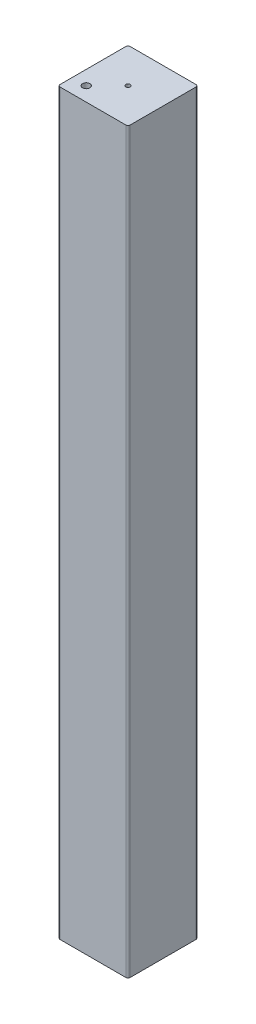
from build123d import *

# Parameters (mm, degrees)
SKETCH1_W           = 95
SKETCH1_H           = 95
EXTRUDE_L_NGD_DEPTH = 1000
SKETCH3_R           = 3
CUT_SKRUVH_L_DEPTH  = 25
SKETCH2_R           = 5
CUT_TAPPH_L_DEPTH   = 15
FILLET1_R           = 3


with BuildPart() as part:
    # Sketch1 → Extrude l_ngd (new body)
    with BuildSketch(Plane(origin=(0, 0, 0), x_dir=(1, 0, 0), z_dir=(0, 1, 0))):
        Rectangle(SKETCH1_W, SKETCH1_H)
    extrude(amount=EXTRUDE_L_NGD_DEPTH)

    # Sketch3 → Cut-skruvh_l (cut)
    with BuildSketch(Plane(origin=(0, 1000, -1000), x_dir=(1, 0, 0), z_dir=(0, -1, 0))):
        with Locations(Location((0, 1000, 0), (0, 0, 270))):
            Circle(SKETCH3_R)
    extrude(amount=CUT_SKRUVH_L_DEPTH, mode=Mode.SUBTRACT)

    # Sketch2 → Cut-tapph_l (cut)
    with BuildSketch(Plane(origin=(0, 1000, -1000), x_dir=(1, 0, 0), z_dir=(0, -1, 0))):
        with Locations(Location((-28.284271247, 1028.284271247, 0), (0, 0, 270))):
            Circle(SKETCH2_R)
    extrude(amount=CUT_TAPPH_L_DEPTH, mode=Mode.SUBTRACT)

    # Fillet1
    fillet1_edges = [part.edges().sort_by_distance(p)[0] for p in [
        (47.5, 500, 47.5),
        (-47.5, 500, 47.5),
        (-47.5, 500, -47.5),
        (47.5, 500, -47.5),
    ]]
    fillet(fillet1_edges, radius=FILLET1_R)


solid = part.part
